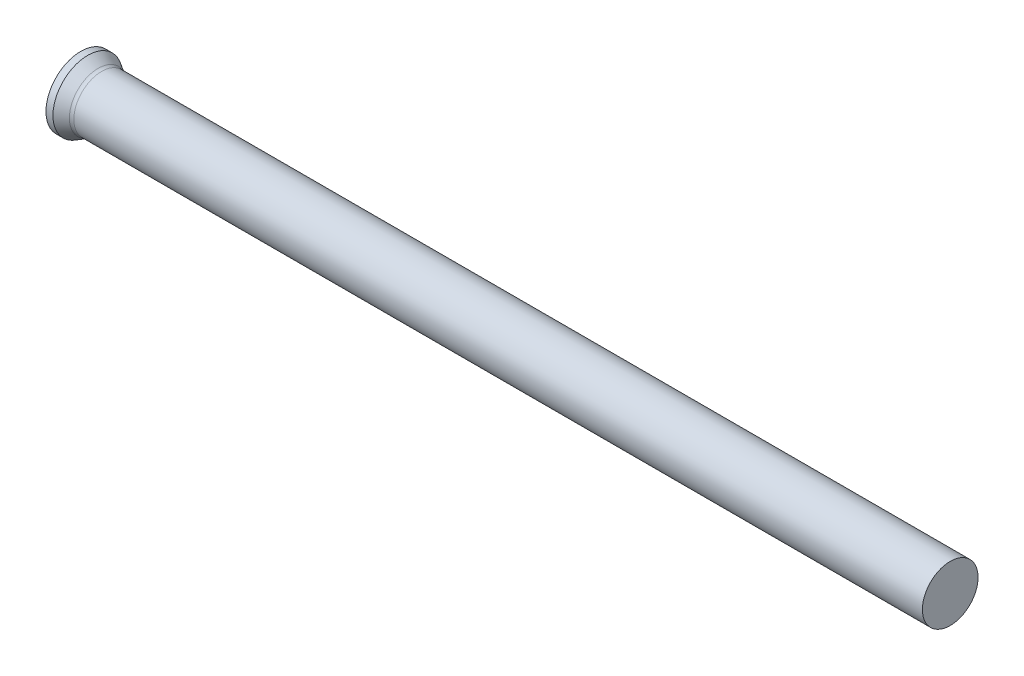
ISO-10303-21;
HEADER;
FILE_DESCRIPTION(('STEP AP214'),'2;1');
FILE_NAME('part.step','',(''),(''),'','','');
FILE_SCHEMA(('AUTOMOTIVE_DESIGN { 1 0 10303 214 1 1 1 1 }'));
ENDSEC;
DATA;
#1=APPLICATION_CONTEXT('core data for automotive mechanical design processes');
#2=APPLICATION_PROTOCOL_DEFINITION('international standard','automotive_design',2000,#1);
#3=PRODUCT_CONTEXT('',#1,'mechanical');
#4=PRODUCT('Part','Part','',(#3));
#5=PRODUCT_RELATED_PRODUCT_CATEGORY('part','',(#4));
#6=PRODUCT_DEFINITION_FORMATION('','',#4);
#7=PRODUCT_DEFINITION_CONTEXT('part definition',#1,'design');
#8=PRODUCT_DEFINITION('design','',#6,#7);
#9=PRODUCT_DEFINITION_SHAPE('','',#8);
#10=(LENGTH_UNIT() NAMED_UNIT(*) SI_UNIT(.MILLI.,.METRE.));
#11=(NAMED_UNIT(*) PLANE_ANGLE_UNIT() SI_UNIT($,.RADIAN.));
#12=(NAMED_UNIT(*) SI_UNIT($,.STERADIAN.) SOLID_ANGLE_UNIT());
#13=UNCERTAINTY_MEASURE_WITH_UNIT(LENGTH_MEASURE(1.E-05),#10,'distance_accuracy_value','');
#14=(GEOMETRIC_REPRESENTATION_CONTEXT(3) GLOBAL_UNCERTAINTY_ASSIGNED_CONTEXT((#13)) GLOBAL_UNIT_ASSIGNED_CONTEXT((#10,
#11,#12)) REPRESENTATION_CONTEXT('',''));
#15=CARTESIAN_POINT('',(0.,0.,0.));
#16=DIRECTION('',(0.,0.,1.));
#17=DIRECTION('',(1.,0.,0.));
#18=AXIS2_PLACEMENT_3D('',#15,#16,#17);
#19=CARTESIAN_POINT('',(0.,0.,0.));
#20=DIRECTION('',(1.,0.,0.));
#21=DIRECTION('',(0.,0.,-1.));
#22=AXIS2_PLACEMENT_3D('',#19,#20,#21);
#23=PLANE('',#22);
#24=CARTESIAN_POINT('',(0.,0.,0.));
#25=DIRECTION('',(-1.,0.,0.));
#26=DIRECTION('',(0.,0.,1.));
#27=AXIS2_PLACEMENT_3D('',#24,#25,#26);
#28=CIRCLE('',#27,5.);
#29=CARTESIAN_POINT('',(0.,0.,5.));
#30=VERTEX_POINT('',#29);
#31=EDGE_CURVE('E25',#30,#30,#28,.T.);
#32=ORIENTED_EDGE('',*,*,#31,.T.);
#33=EDGE_LOOP('',(#32));
#34=FACE_BOUND('',#33,.T.);
#35=ADVANCED_FACE('F14',(#34),#23,.F.);
#36=CARTESIAN_POINT('',(0.,0.,0.));
#37=DIRECTION('',(-1.,0.,0.));
#38=DIRECTION('',(0.,0.,1.));
#39=AXIS2_PLACEMENT_3D('',#36,#37,#38);
#40=CYLINDRICAL_SURFACE('',#39,5.);
#41=ORIENTED_EDGE('',*,*,#31,.F.);
#42=EDGE_LOOP('',(#41));
#43=FACE_BOUND('',#42,.T.);
#44=CARTESIAN_POINT('',(0.997949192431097,0.,0.));
#45=DIRECTION('',(-1.,0.,0.));
#46=DIRECTION('',(0.,0.,1.));
#47=AXIS2_PLACEMENT_3D('',#44,#45,#46);
#48=CIRCLE('',#47,5.);
#49=CARTESIAN_POINT('',(0.997949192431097,0.,5.));
#50=VERTEX_POINT('',#49);
#51=EDGE_CURVE('E29',#50,#50,#48,.T.);
#52=ORIENTED_EDGE('',*,*,#51,.T.);
#53=EDGE_LOOP('',(#52));
#54=FACE_BOUND('',#53,.T.);
#55=ADVANCED_FACE('F53',(#43,#54),#40,.T.);
#56=CARTESIAN_POINT('',(2.73,0.,0.));
#57=DIRECTION('',(-1.,0.,0.));
#58=DIRECTION('',(0.,0.,1.));
#59=AXIS2_PLACEMENT_3D('',#56,#57,#58);
#60=CONICAL_SURFACE('',#59,4.,0.523598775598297);
#61=CARTESIAN_POINT('',(2.49794919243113,0.,0.));
#62=DIRECTION('',(-1.,0.,0.));
#63=DIRECTION('',(0.,0.,1.));
#64=AXIS2_PLACEMENT_3D('',#61,#62,#63);
#65=CIRCLE('',#64,4.13397459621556);
#66=CARTESIAN_POINT('',(2.49794919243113,0.,4.13397459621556));
#67=VERTEX_POINT('',#66);
#68=EDGE_CURVE('E21',#67,#67,#65,.T.);
#69=ORIENTED_EDGE('',*,*,#68,.T.);
#70=EDGE_LOOP('',(#69));
#71=FACE_BOUND('',#70,.T.);
#72=ORIENTED_EDGE('',*,*,#51,.F.);
#73=EDGE_LOOP('',(#72));
#74=FACE_BOUND('',#73,.T.);
#75=ADVANCED_FACE('F50',(#71,#74),#60,.T.);
#76=CARTESIAN_POINT('',(0.,0.,0.));
#77=DIRECTION('',(-1.,0.,0.));
#78=DIRECTION('',(0.,0.,1.));
#79=AXIS2_PLACEMENT_3D('',#76,#77,#78);
#80=CYLINDRICAL_SURFACE('',#79,4.);
#81=CARTESIAN_POINT('',(2.99794919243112,0.,0.));
#82=DIRECTION('',(-1.,0.,0.));
#83=DIRECTION('',(0.,0.,1.));
#84=AXIS2_PLACEMENT_3D('',#81,#82,#83);
#85=CIRCLE('',#84,4.);
#86=CARTESIAN_POINT('',(2.99794919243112,0.,4.));
#87=VERTEX_POINT('',#86);
#88=EDGE_CURVE('E9',#87,#87,#85,.F.);
#89=ORIENTED_EDGE('',*,*,#88,.T.);
#90=EDGE_LOOP('',(#89));
#91=FACE_BOUND('',#90,.T.);
#92=CARTESIAN_POINT('',(125.,0.,0.));
#93=DIRECTION('',(-1.,0.,0.));
#94=DIRECTION('',(0.,0.,1.));
#95=AXIS2_PLACEMENT_3D('',#92,#93,#94);
#96=CIRCLE('',#95,4.);
#97=CARTESIAN_POINT('',(125.,0.,4.));
#98=VERTEX_POINT('',#97);
#99=EDGE_CURVE('E34',#98,#98,#96,.T.);
#100=ORIENTED_EDGE('',*,*,#99,.T.);
#101=EDGE_LOOP('',(#100));
#102=FACE_BOUND('',#101,.T.);
#103=ADVANCED_FACE('F38',(#91,#102),#80,.T.);
#104=CARTESIAN_POINT('',(125.,4.,0.));
#105=DIRECTION('',(-1.,0.,0.));
#106=DIRECTION('',(0.,0.,1.));
#107=AXIS2_PLACEMENT_3D('',#104,#105,#106);
#108=PLANE('',#107);
#109=ORIENTED_EDGE('',*,*,#99,.F.);
#110=EDGE_LOOP('',(#109));
#111=FACE_BOUND('',#110,.T.);
#112=ADVANCED_FACE('F40',(#111),#108,.F.);
#113=CARTESIAN_POINT('',(2.99794919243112,0.,0.));
#114=DIRECTION('',(-1.,0.,0.));
#115=DIRECTION('',(0.,0.,1.));
#116=AXIS2_PLACEMENT_3D('',#113,#114,#115);
#117=TOROIDAL_SURFACE('',#116,5.,1.);
#118=ORIENTED_EDGE('',*,*,#88,.F.);
#119=EDGE_LOOP('',(#118));
#120=FACE_BOUND('',#119,.T.);
#121=ORIENTED_EDGE('',*,*,#68,.F.);
#122=EDGE_LOOP('',(#121));
#123=FACE_BOUND('',#122,.T.);
#124=ADVANCED_FACE('F16',(#120,#123),#117,.F.);
#125=CLOSED_SHELL('',(#35,#55,#75,#103,#112,#124));
#126=MANIFOLD_SOLID_BREP('B1',#125);
#127=ADVANCED_BREP_SHAPE_REPRESENTATION('',(#18,#126),#14);
#128=SHAPE_DEFINITION_REPRESENTATION(#9,#127);
ENDSEC;
END-ISO-10303-21;
